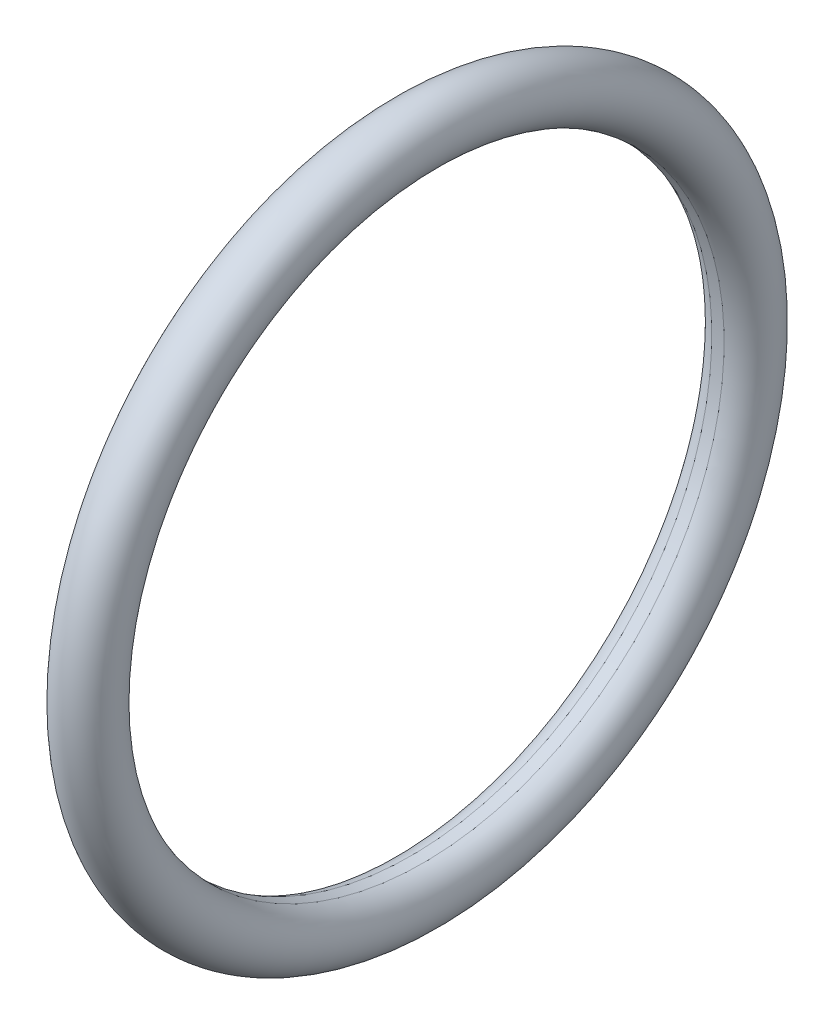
from build123d import *


with BuildPart() as part:
    # Esquisse1 → Base-R_volution (revolve)
    with BuildSketch(Plane.XY, mode=Mode.PRIVATE) as base_r_volution_sk:
        with BuildLine():
            Line((-9.68296609, 85.53388626), (-10.31703391, 85.53388626))
            ThreePointArc((-10.31703391, 85.53388626), (-11.113621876, 85.995088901), (-11.490864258, 86.834700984))
            Line((-11.490864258, 86.834700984), (-11.490864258, 87.165299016))
            ThreePointArc((-11.490864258, 87.165299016), (-8.995088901, 88.113621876), (-9.68296609, 85.53388626))
        make_face()
    revolve(base_r_volution_sk.sketch.rotate(Axis((-20, 70, 0), (1, 0, 0)), 90), axis=Axis((-20, 70, 0), (1, 0, 0)))


solid = part.part
